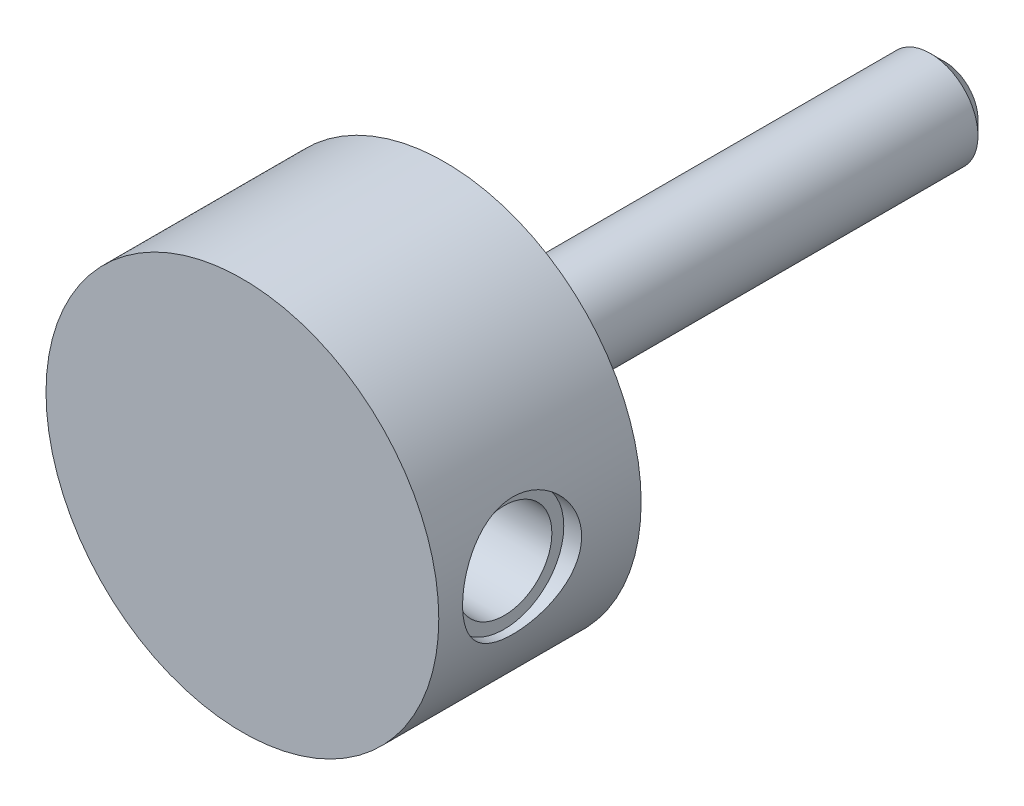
ISO-10303-21;
HEADER;
FILE_DESCRIPTION(('STEP AP214'),'2;1');
FILE_NAME('part.step','',(''),(''),'','','');
FILE_SCHEMA(('AUTOMOTIVE_DESIGN { 1 0 10303 214 1 1 1 1 }'));
ENDSEC;
DATA;
#1=APPLICATION_CONTEXT('core data for automotive mechanical design processes');
#2=APPLICATION_PROTOCOL_DEFINITION('international standard','automotive_design',2000,#1);
#3=PRODUCT_CONTEXT('',#1,'mechanical');
#4=PRODUCT('Part','Part','',(#3));
#5=PRODUCT_RELATED_PRODUCT_CATEGORY('part','',(#4));
#6=PRODUCT_DEFINITION_FORMATION('','',#4);
#7=PRODUCT_DEFINITION_CONTEXT('part definition',#1,'design');
#8=PRODUCT_DEFINITION('design','',#6,#7);
#9=PRODUCT_DEFINITION_SHAPE('','',#8);
#10=(LENGTH_UNIT() NAMED_UNIT(*) SI_UNIT(.MILLI.,.METRE.));
#11=(NAMED_UNIT(*) PLANE_ANGLE_UNIT() SI_UNIT($,.RADIAN.));
#12=(NAMED_UNIT(*) SI_UNIT($,.STERADIAN.) SOLID_ANGLE_UNIT());
#13=UNCERTAINTY_MEASURE_WITH_UNIT(LENGTH_MEASURE(1.E-05),#10,'distance_accuracy_value','');
#14=(GEOMETRIC_REPRESENTATION_CONTEXT(3) GLOBAL_UNCERTAINTY_ASSIGNED_CONTEXT((#13)) GLOBAL_UNIT_ASSIGNED_CONTEXT((#10,
#11,#12)) REPRESENTATION_CONTEXT('',''));
#15=CARTESIAN_POINT('',(0.,0.,0.));
#16=DIRECTION('',(0.,0.,1.));
#17=DIRECTION('',(1.,0.,0.));
#18=AXIS2_PLACEMENT_3D('',#15,#16,#17);
#19=CARTESIAN_POINT('',(0.,0.,-50.));
#20=DIRECTION('',(0.,0.,1.));
#21=DIRECTION('',(1.,0.,0.));
#22=AXIS2_PLACEMENT_3D('',#19,#20,#21);
#23=CYLINDRICAL_SURFACE('',#22,4.);
#24=CARTESIAN_POINT('',(0.,0.,-38.8));
#25=DIRECTION('',(0.,0.,-1.));
#26=DIRECTION('',(-1.,0.,0.));
#27=AXIS2_PLACEMENT_3D('',#24,#25,#26);
#28=CIRCLE('',#27,4.);
#29=CARTESIAN_POINT('',(-4.,0.,-38.8));
#30=VERTEX_POINT('',#29);
#31=EDGE_CURVE('E8',#30,#30,#28,.F.);
#32=ORIENTED_EDGE('',*,*,#31,.T.);
#33=EDGE_LOOP('',(#32));
#34=FACE_BOUND('',#33,.T.);
#35=CARTESIAN_POINT('',(0.,0.,0.));
#36=DIRECTION('',(0.,0.,1.));
#37=DIRECTION('',(1.,0.,0.));
#38=AXIS2_PLACEMENT_3D('',#35,#36,#37);
#39=CIRCLE('',#38,4.);
#40=CARTESIAN_POINT('',(4.,0.,0.));
#41=VERTEX_POINT('',#40);
#42=EDGE_CURVE('E23',#41,#41,#39,.F.);
#43=ORIENTED_EDGE('',*,*,#42,.T.);
#44=EDGE_LOOP('',(#43));
#45=FACE_BOUND('',#44,.T.);
#46=ADVANCED_FACE('F12',(#34,#45),#23,.T.);
#47=CARTESIAN_POINT('',(0.,0.,0.));
#48=DIRECTION('',(0.,0.,1.));
#49=DIRECTION('',(1.,0.,0.));
#50=AXIS2_PLACEMENT_3D('',#47,#48,#49);
#51=PLANE('',#50);
#52=CARTESIAN_POINT('',(0.,0.,0.));
#53=DIRECTION('',(0.,0.,1.));
#54=DIRECTION('',(1.,0.,0.));
#55=AXIS2_PLACEMENT_3D('',#52,#53,#54);
#56=CIRCLE('',#55,6.75);
#57=CARTESIAN_POINT('',(6.75,0.,0.));
#58=VERTEX_POINT('',#57);
#59=EDGE_CURVE('E38',#58,#58,#56,.T.);
#60=ORIENTED_EDGE('',*,*,#59,.F.);
#61=EDGE_LOOP('',(#60));
#62=FACE_BOUND('',#61,.T.);
#63=ORIENTED_EDGE('',*,*,#42,.F.);
#64=EDGE_LOOP('',(#63));
#65=FACE_BOUND('',#64,.T.);
#66=ADVANCED_FACE('F50',(#62,#65),#51,.F.);
#67=CARTESIAN_POINT('',(0.,0.,40.));
#68=DIRECTION('',(0.,0.,1.));
#69=DIRECTION('',(1.,0.,0.));
#70=AXIS2_PLACEMENT_3D('',#67,#68,#69);
#71=CYLINDRICAL_SURFACE('',#70,6.75);
#72=CARTESIAN_POINT('',(0.,0.,2.));
#73=DIRECTION('',(0.,0.,1.));
#74=DIRECTION('',(1.,0.,0.));
#75=AXIS2_PLACEMENT_3D('',#72,#73,#74);
#76=CIRCLE('',#75,6.75);
#77=CARTESIAN_POINT('',(6.75,0.,2.));
#78=VERTEX_POINT('',#77);
#79=EDGE_CURVE('E27',#78,#78,#76,.T.);
#80=ORIENTED_EDGE('',*,*,#79,.F.);
#81=EDGE_LOOP('',(#80));
#82=FACE_BOUND('',#81,.T.);
#83=ORIENTED_EDGE('',*,*,#59,.T.);
#84=EDGE_LOOP('',(#83));
#85=FACE_BOUND('',#84,.T.);
#86=ADVANCED_FACE('F52',(#82,#85),#71,.T.);
#87=CARTESIAN_POINT('',(6.75,0.,2.));
#88=DIRECTION('',(0.,0.,1.));
#89=DIRECTION('',(1.,0.,0.));
#90=AXIS2_PLACEMENT_3D('',#87,#88,#89);
#91=PLANE('',#90);
#92=CARTESIAN_POINT('',(0.,0.,2.));
#93=DIRECTION('',(0.,0.,1.));
#94=DIRECTION('',(1.,0.,0.));
#95=AXIS2_PLACEMENT_3D('',#92,#93,#94);
#96=CIRCLE('',#95,16.5);
#97=CARTESIAN_POINT('',(16.5,0.,2.));
#98=VERTEX_POINT('',#97);
#99=EDGE_CURVE('E104',#98,#98,#96,.T.);
#100=ORIENTED_EDGE('',*,*,#99,.F.);
#101=EDGE_LOOP('',(#100));
#102=FACE_BOUND('',#101,.T.);
#103=ORIENTED_EDGE('',*,*,#79,.T.);
#104=EDGE_LOOP('',(#103));
#105=FACE_BOUND('',#104,.T.);
#106=ADVANCED_FACE('F65',(#102,#105),#91,.F.);
#107=CARTESIAN_POINT('',(0.,0.,40.));
#108=DIRECTION('',(0.,0.,1.));
#109=DIRECTION('',(1.,0.,0.));
#110=AXIS2_PLACEMENT_3D('',#107,#108,#109);
#111=CYLINDRICAL_SURFACE('',#110,16.5);
#112=CARTESIAN_POINT('',(16.5,0.,7.));
#113=CARTESIAN_POINT('',(16.499997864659,-0.27416656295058,7.00000297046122));
#114=CARTESIAN_POINT('',(16.493101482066,-0.548363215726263,7.02262484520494));
#115=CARTESIAN_POINT('',(16.4662646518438,-1.08876356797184,7.11229452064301));
#116=CARTESIAN_POINT('',(16.446320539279,-1.35496499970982,7.17935480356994));
#117=CARTESIAN_POINT('',(16.3955720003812,-1.87150278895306,7.35545075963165));
#118=CARTESIAN_POINT('',(16.3647837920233,-2.12186218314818,7.4644237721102));
#119=CARTESIAN_POINT('',(16.2955420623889,-2.60075521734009,7.72099257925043));
#120=CARTESIAN_POINT('',(16.2570874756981,-2.82928581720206,7.86859374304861));
#121=CARTESIAN_POINT('',(16.1753529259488,-3.26471495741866,8.20277426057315));
#122=CARTESIAN_POINT('',(16.1319725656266,-3.47088543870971,8.39027763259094));
#123=CARTESIAN_POINT('',(16.0458704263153,-3.84938917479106,8.79697111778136));
#124=CARTESIAN_POINT('',(16.003148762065,-4.02171659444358,9.0161666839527));
#125=CARTESIAN_POINT('',(15.9221353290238,-4.33150150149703,9.48621682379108));
#126=CARTESIAN_POINT('',(15.8839681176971,-4.46806535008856,9.73768383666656));
#127=CARTESIAN_POINT('',(15.8178878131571,-4.69666762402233,10.2613575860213));
#128=CARTESIAN_POINT('',(15.7899722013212,-4.78871698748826,10.5335592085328));
#129=CARTESIAN_POINT('',(15.748602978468,-4.92304273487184,11.0827901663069));
#130=CARTESIAN_POINT('',(15.7347597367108,-4.96666335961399,11.3594605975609));
#131=CARTESIAN_POINT('',(15.7219440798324,-5.00709144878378,11.9165124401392));
#132=CARTESIAN_POINT('',(15.7229679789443,-5.00391051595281,12.1968929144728));
#133=CARTESIAN_POINT('',(15.7394259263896,-4.95188056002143,12.7424297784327));
#134=CARTESIAN_POINT('',(15.7543266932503,-4.90472150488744,13.0077661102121));
#135=CARTESIAN_POINT('',(15.7959958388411,-4.76880670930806,13.5265684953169));
#136=CARTESIAN_POINT('',(15.8227654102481,-4.68004678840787,13.7800333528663));
#137=CARTESIAN_POINT('',(15.8855774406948,-4.46221737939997,14.2720056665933));
#138=CARTESIAN_POINT('',(15.9217437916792,-4.33260397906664,14.5102558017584));
#139=CARTESIAN_POINT('',(15.9992154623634,-4.03712482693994,14.9621878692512));
#140=CARTESIAN_POINT('',(16.0405220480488,-3.87125013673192,15.1758637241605));
#141=CARTESIAN_POINT('',(16.125777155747,-3.49958783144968,15.5821595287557));
#142=CARTESIAN_POINT('',(16.1697632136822,-3.29239951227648,15.7734925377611));
#143=CARTESIAN_POINT('',(16.2538615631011,-2.84832978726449,16.1190003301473));
#144=CARTESIAN_POINT('',(16.2939736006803,-2.61144643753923,16.2731726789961));
#145=CARTESIAN_POINT('',(16.3661834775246,-2.11233821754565,16.540785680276));
#146=CARTESIAN_POINT('',(16.3982236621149,-1.84994861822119,16.6539357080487));
#147=CARTESIAN_POINT('',(16.4502641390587,-1.30866646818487,16.8341173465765));
#148=CARTESIAN_POINT('',(16.4702678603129,-1.02977864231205,16.9011620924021));
#149=CARTESIAN_POINT('',(16.4954369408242,-0.474353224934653,16.985075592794));
#150=CARTESIAN_POINT('',(16.5011177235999,-0.198102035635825,17.0036880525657));
#151=CARTESIAN_POINT('',(16.4985159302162,0.353597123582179,16.99510293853));
#152=CARTESIAN_POINT('',(16.4902352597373,0.629045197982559,16.9679116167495));
#153=CARTESIAN_POINT('',(16.4609787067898,1.16470330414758,16.869898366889));
#154=CARTESIAN_POINT('',(16.4403007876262,1.42511840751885,16.8000997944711));
#155=CARTESIAN_POINT('',(16.388649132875,1.93048096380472,16.6200887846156));
#156=CARTESIAN_POINT('',(16.3576741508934,2.17542653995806,16.5098714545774));
#157=CARTESIAN_POINT('',(16.2877277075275,2.64927766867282,16.2492534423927));
#158=CARTESIAN_POINT('',(16.2485858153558,2.87767261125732,16.097971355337));
#159=CARTESIAN_POINT('',(16.1667951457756,3.30642612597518,15.7605859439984));
#160=CARTESIAN_POINT('',(16.1241454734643,3.50677750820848,15.5744737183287));
#161=CARTESIAN_POINT('',(16.0381606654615,3.88146430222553,15.1645160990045));
#162=CARTESIAN_POINT('',(15.9948588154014,4.05455854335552,14.9395268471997));
#163=CARTESIAN_POINT('',(15.9141467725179,4.36062787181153,14.4627539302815));
#164=CARTESIAN_POINT('',(15.8767364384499,4.49360392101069,14.2109709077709));
#165=CARTESIAN_POINT('',(15.8124706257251,4.71477026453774,13.6884965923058));
#166=CARTESIAN_POINT('',(15.7855679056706,4.80316154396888,13.4178965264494));
#167=CARTESIAN_POINT('',(15.7455304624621,4.93284562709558,12.8646819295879));
#168=CARTESIAN_POINT('',(15.732390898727,4.97415499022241,12.5820716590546));
#169=CARTESIAN_POINT('',(15.7218509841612,5.00736143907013,12.0257720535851));
#170=CARTESIAN_POINT('',(15.7238051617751,5.00128483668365,11.7522143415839));
#171=CARTESIAN_POINT('',(15.7416767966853,4.94474176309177,11.2102140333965));
#172=CARTESIAN_POINT('',(15.7575936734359,4.89427713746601,10.9417712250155));
#173=CARTESIAN_POINT('',(15.8011599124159,4.75171037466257,10.4210074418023));
#174=CARTESIAN_POINT('',(15.8286548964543,4.66015510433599,10.1685228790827));
#175=CARTESIAN_POINT('',(15.8922482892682,4.43843275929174,9.68229661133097));
#176=CARTESIAN_POINT('',(15.9283483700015,4.30825817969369,9.44855856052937));
#177=CARTESIAN_POINT('',(16.0067548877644,4.00734203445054,8.99708364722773));
#178=CARTESIAN_POINT('',(16.0492418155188,3.83527527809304,8.78026142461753));
#179=CARTESIAN_POINT('',(16.1347696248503,3.45783157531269,8.3779118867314));
#180=CARTESIAN_POINT('',(16.1778106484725,3.25244592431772,8.19239277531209));
#181=CARTESIAN_POINT('',(16.2611473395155,2.80676565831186,7.85235596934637));
#182=CARTESIAN_POINT('',(16.301321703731,2.56560775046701,7.69893691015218));
#183=CARTESIAN_POINT('',(16.3729264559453,2.05970384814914,7.43503282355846));
#184=CARTESIAN_POINT('',(16.4043607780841,1.79496853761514,7.32452847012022));
#185=CARTESIAN_POINT('',(16.4523310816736,1.27725626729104,7.15905013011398));
#186=CARTESIAN_POINT('',(16.4700574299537,1.02582323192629,7.09957036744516));
#187=CARTESIAN_POINT('',(16.4938918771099,0.516268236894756,7.02004735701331));
#188=CARTESIAN_POINT('',(16.5000020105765,0.258147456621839,6.999997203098));
#189=CARTESIAN_POINT('',(16.5,0.,7.));
#190=B_SPLINE_CURVE_WITH_KNOTS('',3,(#112,#113,#114,#115,#116,#117,#118,#119,#120,#121,#122,
#123,#124,#125,#126,#127,#128,#129,#130,#131,#132,#133,#134,#135,#136,#137,#138,#139,#140,#141,
#142,#143,#144,#145,#146,#147,#148,#149,#150,#151,#152,#153,#154,#155,#156,#157,#158,#159,#160,
#161,#162,#163,#164,#165,#166,#167,#168,#169,#170,#171,#172,#173,#174,#175,#176,#177,#178,#179,
#180,#181,#182,#183,#184,#185,#186,#187,#188,#189),.UNSPECIFIED.,.T.,.F.,(4,2,2,2,2,2,2,2,2,2,2,
2,2,2,2,2,2,2,2,2,2,2,2,2,2,2,2,2,2,2,2,2,2,2,2,2,2,2,4),(0.,0.82155130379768,1.64333346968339,
2.46389179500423,3.28456423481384,4.12684629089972,4.96927344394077,5.83108565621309,
6.69268599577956,7.52972147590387,8.36654944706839,9.1724896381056,9.97851083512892,
10.7957518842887,11.6131946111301,12.4655059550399,13.3178731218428,14.1761660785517,
15.0342144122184,15.8609136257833,16.6875000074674,17.49497421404,18.302546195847,
19.1290491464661,19.9557636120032,20.8131534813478,21.6705227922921,22.5239918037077,
23.3771605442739,24.194052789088,25.0109110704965,25.8172062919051,26.6236583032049,
27.4600121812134,28.2965849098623,29.1582870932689,30.0196007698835,30.7932856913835,
31.5668350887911),.UNSPECIFIED.);
#191=CARTESIAN_POINT('',(16.5,0.,7.));
#192=VERTEX_POINT('',#191);
#193=EDGE_CURVE('E30',#192,#192,#190,.T.);
#194=ORIENTED_EDGE('',*,*,#193,.T.);
#195=EDGE_LOOP('',(#194));
#196=FACE_BOUND('',#195,.T.);
#197=CARTESIAN_POINT('',(0.,0.,19.));
#198=DIRECTION('',(0.,0.,1.));
#199=DIRECTION('',(1.,0.,0.));
#200=AXIS2_PLACEMENT_3D('',#197,#198,#199);
#201=CIRCLE('',#200,16.5);
#202=CARTESIAN_POINT('',(16.5,0.,19.));
#203=VERTEX_POINT('',#202);
#204=EDGE_CURVE('E103',#203,#203,#201,.T.);
#205=ORIENTED_EDGE('',*,*,#204,.F.);
#206=EDGE_LOOP('',(#205));
#207=FACE_BOUND('',#206,.T.);
#208=ORIENTED_EDGE('',*,*,#99,.T.);
#209=EDGE_LOOP('',(#208));
#210=FACE_BOUND('',#209,.T.);
#211=ADVANCED_FACE('F41',(#196,#207,#210),#111,.T.);
#212=CARTESIAN_POINT('',(16.5,0.,19.));
#213=DIRECTION('',(0.,0.,-1.));
#214=DIRECTION('',(-1.,0.,0.));
#215=AXIS2_PLACEMENT_3D('',#212,#213,#214);
#216=PLANE('',#215);
#217=ORIENTED_EDGE('',*,*,#204,.T.);
#218=EDGE_LOOP('',(#217));
#219=FACE_BOUND('',#218,.T.);
#220=ADVANCED_FACE('F54',(#219),#216,.F.);
#221=CARTESIAN_POINT('',(15.,0.,12.));
#222=DIRECTION('',(1.,0.,0.));
#223=DIRECTION('',(0.,0.,-1.));
#224=AXIS2_PLACEMENT_3D('',#221,#222,#223);
#225=CYLINDRICAL_SURFACE('',#224,5.);
#226=CARTESIAN_POINT('',(15.,0.,12.));
#227=DIRECTION('',(1.,0.,0.));
#228=DIRECTION('',(0.,0.,-1.));
#229=AXIS2_PLACEMENT_3D('',#226,#227,#228);
#230=CIRCLE('',#229,5.);
#231=CARTESIAN_POINT('',(15.,0.,7.));
#232=VERTEX_POINT('',#231);
#233=EDGE_CURVE('E39',#232,#232,#230,.T.);
#234=ORIENTED_EDGE('',*,*,#233,.F.);
#235=EDGE_LOOP('',(#234));
#236=FACE_BOUND('',#235,.T.);
#237=ORIENTED_EDGE('',*,*,#193,.F.);
#238=EDGE_LOOP('',(#237));
#239=FACE_BOUND('',#238,.T.);
#240=ADVANCED_FACE('F48',(#236,#239),#225,.F.);
#241=CARTESIAN_POINT('',(15.,0.,12.));
#242=DIRECTION('',(1.,0.,0.));
#243=DIRECTION('',(0.,0.,-1.));
#244=AXIS2_PLACEMENT_3D('',#241,#242,#243);
#245=PLANE('',#244);
#246=CARTESIAN_POINT('',(15.,0.,12.));
#247=DIRECTION('',(1.,0.,0.));
#248=DIRECTION('',(0.,0.,-1.));
#249=AXIS2_PLACEMENT_3D('',#246,#247,#248);
#250=CIRCLE('',#249,4.);
#251=CARTESIAN_POINT('',(15.,0.,8.));
#252=VERTEX_POINT('',#251);
#253=EDGE_CURVE('E92',#252,#252,#250,.T.);
#254=ORIENTED_EDGE('',*,*,#253,.F.);
#255=EDGE_LOOP('',(#254));
#256=FACE_BOUND('',#255,.T.);
#257=ORIENTED_EDGE('',*,*,#233,.T.);
#258=EDGE_LOOP('',(#257));
#259=FACE_BOUND('',#258,.T.);
#260=ADVANCED_FACE('F63',(#256,#259),#245,.T.);
#261=CARTESIAN_POINT('',(7.,0.,12.));
#262=DIRECTION('',(1.,0.,0.));
#263=DIRECTION('',(0.,0.,-1.));
#264=AXIS2_PLACEMENT_3D('',#261,#262,#263);
#265=CYLINDRICAL_SURFACE('',#264,4.);
#266=CARTESIAN_POINT('',(7.,0.,12.));
#267=DIRECTION('',(1.,0.,0.));
#268=DIRECTION('',(0.,0.,-1.));
#269=AXIS2_PLACEMENT_3D('',#266,#267,#268);
#270=CIRCLE('',#269,4.);
#271=CARTESIAN_POINT('',(7.,0.,8.));
#272=VERTEX_POINT('',#271);
#273=EDGE_CURVE('E95',#272,#272,#270,.T.);
#274=ORIENTED_EDGE('',*,*,#273,.F.);
#275=EDGE_LOOP('',(#274));
#276=FACE_BOUND('',#275,.T.);
#277=ORIENTED_EDGE('',*,*,#253,.T.);
#278=EDGE_LOOP('',(#277));
#279=FACE_BOUND('',#278,.T.);
#280=ADVANCED_FACE('F80',(#276,#279),#265,.F.);
#281=CARTESIAN_POINT('',(7.,0.,12.));
#282=DIRECTION('',(1.,0.,0.));
#283=DIRECTION('',(0.,0.,-1.));
#284=AXIS2_PLACEMENT_3D('',#281,#282,#283);
#285=PLANE('',#284);
#286=ORIENTED_EDGE('',*,*,#273,.T.);
#287=EDGE_LOOP('',(#286));
#288=FACE_BOUND('',#287,.T.);
#289=ADVANCED_FACE('F77',(#288),#285,.T.);
#290=CARTESIAN_POINT('',(0.,0.,-40.));
#291=DIRECTION('',(0.,0.,-1.));
#292=DIRECTION('',(-1.,0.,0.));
#293=AXIS2_PLACEMENT_3D('',#290,#291,#292);
#294=PLANE('',#293);
#295=CARTESIAN_POINT('',(0.,0.,-40.));
#296=DIRECTION('',(0.,0.,-1.));
#297=DIRECTION('',(-1.,0.,0.));
#298=AXIS2_PLACEMENT_3D('',#295,#296,#297);
#299=CIRCLE('',#298,2.8);
#300=CARTESIAN_POINT('',(-2.8,0.,-40.));
#301=VERTEX_POINT('',#300);
#302=EDGE_CURVE('E19',#301,#301,#299,.T.);
#303=ORIENTED_EDGE('',*,*,#302,.T.);
#304=EDGE_LOOP('',(#303));
#305=FACE_BOUND('',#304,.T.);
#306=ADVANCED_FACE('F76',(#305),#294,.T.);
#307=CARTESIAN_POINT('',(0.,0.,-40.));
#308=DIRECTION('',(0.,0.,1.));
#309=DIRECTION('',(1.,0.,0.));
#310=AXIS2_PLACEMENT_3D('',#307,#308,#309);
#311=CONICAL_SURFACE('',#310,2.8,0.785398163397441);
#312=ORIENTED_EDGE('',*,*,#31,.F.);
#313=EDGE_LOOP('',(#312));
#314=FACE_BOUND('',#313,.T.);
#315=ORIENTED_EDGE('',*,*,#302,.F.);
#316=EDGE_LOOP('',(#315));
#317=FACE_BOUND('',#316,.T.);
#318=ADVANCED_FACE('F14',(#314,#317),#311,.T.);
#319=CLOSED_SHELL('',(#46,#66,#86,#106,#211,#220,#240,#260,#280,#289,#306,#318));
#320=MANIFOLD_SOLID_BREP('B1',#319);
#321=ADVANCED_BREP_SHAPE_REPRESENTATION('',(#18,#320),#14);
#322=SHAPE_DEFINITION_REPRESENTATION(#9,#321);
ENDSEC;
END-ISO-10303-21;
